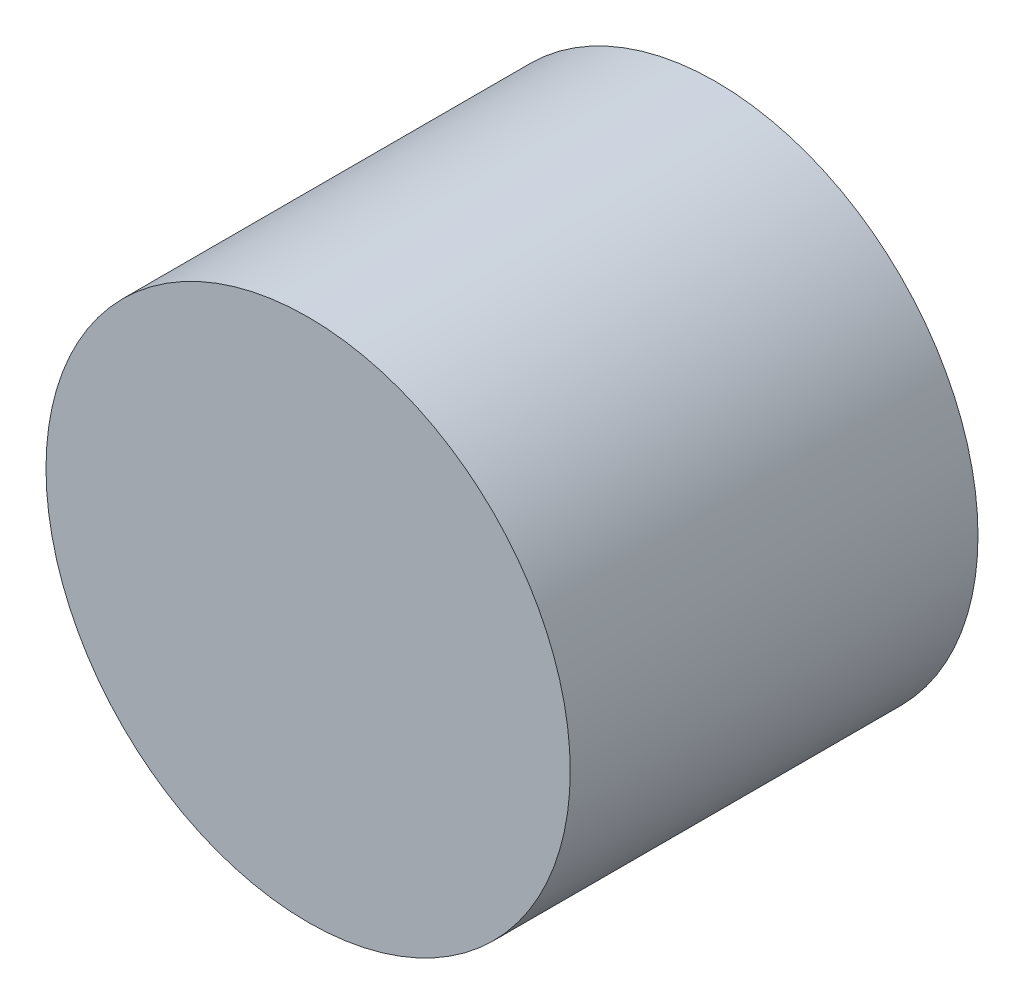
ISO-10303-21;
HEADER;
FILE_DESCRIPTION(('STEP AP214'),'2;1');
FILE_NAME('part.step','',(''),(''),'','','');
FILE_SCHEMA(('AUTOMOTIVE_DESIGN { 1 0 10303 214 1 1 1 1 }'));
ENDSEC;
DATA;
#1=APPLICATION_CONTEXT('core data for automotive mechanical design processes');
#2=APPLICATION_PROTOCOL_DEFINITION('international standard','automotive_design',2000,#1);
#3=PRODUCT_CONTEXT('',#1,'mechanical');
#4=PRODUCT('Part','Part','',(#3));
#5=PRODUCT_RELATED_PRODUCT_CATEGORY('part','',(#4));
#6=PRODUCT_DEFINITION_FORMATION('','',#4);
#7=PRODUCT_DEFINITION_CONTEXT('part definition',#1,'design');
#8=PRODUCT_DEFINITION('design','',#6,#7);
#9=PRODUCT_DEFINITION_SHAPE('','',#8);
#10=(LENGTH_UNIT() NAMED_UNIT(*) SI_UNIT(.MILLI.,.METRE.));
#11=(NAMED_UNIT(*) PLANE_ANGLE_UNIT() SI_UNIT($,.RADIAN.));
#12=(NAMED_UNIT(*) SI_UNIT($,.STERADIAN.) SOLID_ANGLE_UNIT());
#13=UNCERTAINTY_MEASURE_WITH_UNIT(LENGTH_MEASURE(1.E-05),#10,'distance_accuracy_value','');
#14=(GEOMETRIC_REPRESENTATION_CONTEXT(3) GLOBAL_UNCERTAINTY_ASSIGNED_CONTEXT((#13)) GLOBAL_UNIT_ASSIGNED_CONTEXT((#10,
#11,#12)) REPRESENTATION_CONTEXT('',''));
#15=CARTESIAN_POINT('',(0.,0.,0.));
#16=DIRECTION('',(0.,0.,1.));
#17=DIRECTION('',(1.,0.,0.));
#18=AXIS2_PLACEMENT_3D('',#15,#16,#17);
#19=CARTESIAN_POINT('',(2.286,0.,0.));
#20=DIRECTION('',(0.,0.,-1.));
#21=DIRECTION('',(-1.,0.,0.));
#22=AXIS2_PLACEMENT_3D('',#19,#20,#21);
#23=PLANE('',#22);
#24=CARTESIAN_POINT('',(0.,0.,0.));
#25=DIRECTION('',(0.,0.,-1.));
#26=DIRECTION('',(-1.,0.,0.));
#27=AXIS2_PLACEMENT_3D('',#24,#25,#26);
#28=CIRCLE('',#27,2.286);
#29=CARTESIAN_POINT('',(-2.286,0.,0.));
#30=VERTEX_POINT('',#29);
#31=EDGE_CURVE('E18',#30,#30,#28,.F.);
#32=ORIENTED_EDGE('',*,*,#31,.F.);
#33=EDGE_LOOP('',(#32));
#34=FACE_BOUND('',#33,.T.);
#35=ADVANCED_FACE('F15',(#34),#23,.T.);
#36=CARTESIAN_POINT('',(2.286,0.,3.556));
#37=DIRECTION('',(0.,0.,-1.));
#38=DIRECTION('',(-1.,0.,0.));
#39=AXIS2_PLACEMENT_3D('',#36,#37,#38);
#40=PLANE('',#39);
#41=CARTESIAN_POINT('',(0.,0.,3.556));
#42=DIRECTION('',(0.,0.,-1.));
#43=DIRECTION('',(-1.,0.,0.));
#44=AXIS2_PLACEMENT_3D('',#41,#42,#43);
#45=CIRCLE('',#44,2.286);
#46=CARTESIAN_POINT('',(-2.286,0.,3.556));
#47=VERTEX_POINT('',#46);
#48=EDGE_CURVE('E10',#47,#47,#45,.T.);
#49=ORIENTED_EDGE('',*,*,#48,.F.);
#50=EDGE_LOOP('',(#49));
#51=FACE_BOUND('',#50,.T.);
#52=ADVANCED_FACE('F30',(#51),#40,.F.);
#53=CARTESIAN_POINT('',(0.,0.,0.));
#54=DIRECTION('',(0.,0.,-1.));
#55=DIRECTION('',(-1.,0.,0.));
#56=AXIS2_PLACEMENT_3D('',#53,#54,#55);
#57=CYLINDRICAL_SURFACE('',#56,2.286);
#58=ORIENTED_EDGE('',*,*,#31,.T.);
#59=EDGE_LOOP('',(#58));
#60=FACE_BOUND('',#59,.T.);
#61=ORIENTED_EDGE('',*,*,#48,.T.);
#62=EDGE_LOOP('',(#61));
#63=FACE_BOUND('',#62,.T.);
#64=ADVANCED_FACE('F27',(#60,#63),#57,.T.);
#65=CLOSED_SHELL('',(#35,#52,#64));
#66=MANIFOLD_SOLID_BREP('B1',#65);
#67=ADVANCED_BREP_SHAPE_REPRESENTATION('',(#18,#66),#14);
#68=SHAPE_DEFINITION_REPRESENTATION(#9,#67);
ENDSEC;
END-ISO-10303-21;
